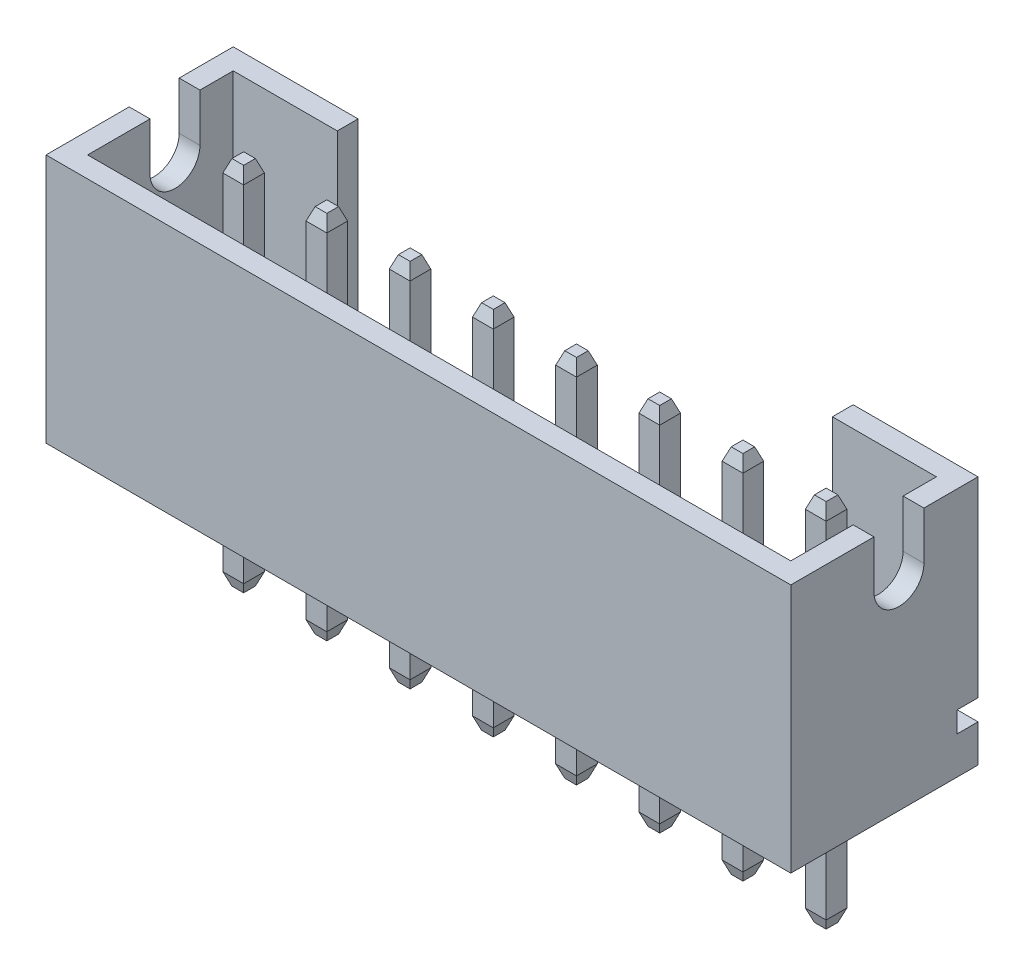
from build123d import *
from OCP.BRepFilletAPI import BRepFilletAPI_MakeChamfer

# Parameters (mm, degrees)
EXTRUDE_3_DEPTH                     = 15.95
EXTRUDE_3_DEPTH_BACK                = 1.95
CUT_EXTRUDE_1_DEPTH                 = 4
EXTRUDE_START                       = -3.4
SKETCH_1_W                          = 0.5
SKETCH_1_H                          = 0.5
EXTRUDE_4_DEPTH                     = 8.9
CHAMFER_1_SIZE                      = 0.3
CHAMFER_1_SIZE2                     = 0.10919107
CHAMFER_2_SIZE                      = 0.3
CHAMFER_2_SIZE2                     = 0.10919107
PATTERN_LINEAR_3_COUNT              = 8
PATTERN_LINEAR_3_PITCH              = 2
CHAMFER_1_OF_PATTERN_LINEAR_3_SIZE  = 0.3
CHAMFER_1_OF_PATTERN_LINEAR_3_SIZE2 = 0.10919107
CHAMFER_2_OF_PATTERN_LINEAR_3_SIZE  = 0.3
CHAMFER_2_OF_PATTERN_LINEAR_3_SIZE2 = 0.10919107


with BuildPart() as part:
    # Sketch 3 → Extrude 3 (new, two sides: drawn at the far end of the back side and taken through both)
    with BuildSketch(Plane(origin=(0, 0, 0), x_dir=(0, 0, -1), z_dir=(1, 0, 0)).offset(-EXTRUDE_3_DEPTH_BACK)):
        with BuildLine():
            Line((-2.8, 0), (1.7, 0))
            Line((1.7, 0), (1.7, 0.9))
            Line((1.7, 0.9), (1.2, 0.9))
            Line((1.2, 0.9), (1.2, 1.4))
            Line((1.2, 1.4), (1.7, 1.4))
            Line((1.7, 1.4), (1.7, 6))
            Line((1.7, 6), (0.4, 6))
            Line((0.4, 6), (0.4, 4.85))
            ThreePointArc((0.4, 4.85), (-0.2, 4.25), (-0.8, 4.85))
            Line((-0.8, 4.85), (-0.8, 6))
            Line((-0.8, 6), (-2.8, 6))
            Line((-2.8, 6), (-2.8, 0))
        make_face()
    extrude(amount=EXTRUDE_3_DEPTH + EXTRUDE_3_DEPTH_BACK)

    # Sketch 4 → Cut-Extrude 1 (cut)
    with BuildSketch(Plane(origin=(0, 6, 0), x_dir=(-1, 0, 0), z_dir=(0, 1, 0))):
        Polygon((-12.95, -1.2), (-15.45, -1.2), (-15.45, 2.3), (1.45, 2.3), (1.45, -1.2), (-1.05, -1.2), (-1.05, -1.7), (-12.95, -1.7), align=None)
    extrude(amount=-CUT_EXTRUDE_1_DEPTH, mode=Mode.SUBTRACT)

    # Sketch 1 → Extrude 4 (add)
    with BuildSketch(Plane(origin=(0, 0, 0), x_dir=(1, 0, 0), z_dir=(0, 1, 0)).offset(EXTRUDE_START)):
        Rectangle(SKETCH_1_W, SKETCH_1_H)
    extrude_4 = extrude(amount=EXTRUDE_4_DEPTH)

    # Chamfer 1: one chamfer whose edges measure the first distance from different faces: ONE call of the kernel's chamfer builder (chamfer() names one face for all edges)
    chamfer_1_edges_1 = [part.edges().sort_by_distance(p)[0] for p in [
        (0, 5.5, 0.25),
    ]]
    chamfer_1_side_1 = [part.faces().sort_by_distance(p)[0] for p in [
        (0, 3.75, 0.25),
    ]]
    chamfer_1_edges_2 = [part.edges().sort_by_distance(p)[0] for p in [
        (0.25, 5.5, 0),
    ]]
    chamfer_1_side_2 = [part.faces().sort_by_distance(p)[0] for p in [
        (0.25, 3.75, 0),
    ]]
    chamfer_1_edges_3 = [part.edges().sort_by_distance(p)[0] for p in [
        (0, 5.5, -0.25),
    ]]
    chamfer_1_side_3 = [part.faces().sort_by_distance(p)[0] for p in [
        (0, 3.75, -0.25),
    ]]
    chamfer_1_edges_4 = [part.edges().sort_by_distance(p)[0] for p in [
        (-0.25, 5.5, 0),
    ]]
    chamfer_1_side_4 = [part.faces().sort_by_distance(p)[0] for p in [
        (-0.25, 3.75, 0),
    ]]
    chamfer_1 = BRepFilletAPI_MakeChamfer(part.part.solid().wrapped)
    for e in chamfer_1_edges_1:
        chamfer_1.Add(CHAMFER_1_SIZE, CHAMFER_1_SIZE2, e.wrapped, chamfer_1_side_1[0].wrapped)  # the first distance lies on this face
    for e in chamfer_1_edges_2:
        chamfer_1.Add(CHAMFER_1_SIZE, CHAMFER_1_SIZE2, e.wrapped, chamfer_1_side_2[0].wrapped)  # the first distance lies on this face
    for e in chamfer_1_edges_3:
        chamfer_1.Add(CHAMFER_1_SIZE, CHAMFER_1_SIZE2, e.wrapped, chamfer_1_side_3[0].wrapped)  # the first distance lies on this face
    for e in chamfer_1_edges_4:
        chamfer_1.Add(CHAMFER_1_SIZE, CHAMFER_1_SIZE2, e.wrapped, chamfer_1_side_4[0].wrapped)  # the first distance lies on this face
    add(Compound.cast(chamfer_1.Shape()), mode=Mode.REPLACE)

    # Chamfer 2: one chamfer whose edges measure the first distance from different faces: ONE call of the kernel's chamfer builder (chamfer() names one face for all edges)
    chamfer_2_edges_1 = [part.edges().sort_by_distance(p)[0] for p in [
        (-0.25, -3.4, 0),
    ]]
    chamfer_2_side_1 = [part.faces().sort_by_distance(p)[0] for p in [
        (-0.25, -1.7, 0),
    ]]
    chamfer_2_edges_2 = [part.edges().sort_by_distance(p)[0] for p in [
        (0, -3.4, -0.25),
    ]]
    chamfer_2_side_2 = [part.faces().sort_by_distance(p)[0] for p in [
        (0, -1.7, -0.25),
    ]]
    chamfer_2_edges_3 = [part.edges().sort_by_distance(p)[0] for p in [
        (0.25, -3.4, 0),
    ]]
    chamfer_2_side_3 = [part.faces().sort_by_distance(p)[0] for p in [
        (0.25, -1.7, 0),
    ]]
    chamfer_2_edges_4 = [part.edges().sort_by_distance(p)[0] for p in [
        (0, -3.4, 0.25),
    ]]
    chamfer_2_side_4 = [part.faces().sort_by_distance(p)[0] for p in [
        (0, -1.7, 0.25),
    ]]
    chamfer_2 = BRepFilletAPI_MakeChamfer(part.part.solid().wrapped)
    for e in chamfer_2_edges_1:
        chamfer_2.Add(CHAMFER_2_SIZE, CHAMFER_2_SIZE2, e.wrapped, chamfer_2_side_1[0].wrapped)  # the first distance lies on this face
    for e in chamfer_2_edges_2:
        chamfer_2.Add(CHAMFER_2_SIZE, CHAMFER_2_SIZE2, e.wrapped, chamfer_2_side_2[0].wrapped)  # the first distance lies on this face
    for e in chamfer_2_edges_3:
        chamfer_2.Add(CHAMFER_2_SIZE, CHAMFER_2_SIZE2, e.wrapped, chamfer_2_side_3[0].wrapped)  # the first distance lies on this face
    for e in chamfer_2_edges_4:
        chamfer_2.Add(CHAMFER_2_SIZE, CHAMFER_2_SIZE2, e.wrapped, chamfer_2_side_4[0].wrapped)  # the first distance lies on this face
    add(Compound.cast(chamfer_2.Shape()), mode=Mode.REPLACE)

    # Pattern Linear 3: Extrude 4 ×8
    with Locations(*[(i * PATTERN_LINEAR_3_PITCH, 0, 0) for i in range(1, PATTERN_LINEAR_3_COUNT)]):
        add(extrude_4)

    # Chamfer 1 of Pattern Linear 3: one chamfer whose edges measure the first distance from different faces: ONE call of the kernel's chamfer builder (chamfer() names one face for all edges)
    chamfer_1_of_pattern_linear_3_edges_1 = [part.edges().sort_by_distance(p)[0] for p in [
        (2, 5.5, 0.25),
    ]]
    chamfer_1_of_pattern_linear_3_side_1 = [part.faces().sort_by_distance(p)[0] for p in [
        (2, 3.75, 0.25),
    ]]
    chamfer_1_of_pattern_linear_3_edges_2 = [part.edges().sort_by_distance(p)[0] for p in [
        (2.25, 5.5, 0),
    ]]
    chamfer_1_of_pattern_linear_3_side_2 = [part.faces().sort_by_distance(p)[0] for p in [
        (2.25, 3.75, 0),
    ]]
    chamfer_1_of_pattern_linear_3_edges_3 = [part.edges().sort_by_distance(p)[0] for p in [
        (2, 5.5, -0.25),
    ]]
    chamfer_1_of_pattern_linear_3_side_3 = [part.faces().sort_by_distance(p)[0] for p in [
        (2, 3.75, -0.25),
    ]]
    chamfer_1_of_pattern_linear_3_edges_4 = [part.edges().sort_by_distance(p)[0] for p in [
        (1.75, 5.5, 0),
    ]]
    chamfer_1_of_pattern_linear_3_side_4 = [part.faces().sort_by_distance(p)[0] for p in [
        (1.75, 3.75, 0),
    ]]
    chamfer_1_of_pattern_linear_3_edges_5 = [part.edges().sort_by_distance(p)[0] for p in [
        (4, 5.5, 0.25),
    ]]
    chamfer_1_of_pattern_linear_3_side_5 = [part.faces().sort_by_distance(p)[0] for p in [
        (4, 3.75, 0.25),
    ]]
    chamfer_1_of_pattern_linear_3_edges_6 = [part.edges().sort_by_distance(p)[0] for p in [
        (4.25, 5.5, 0),
    ]]
    chamfer_1_of_pattern_linear_3_side_6 = [part.faces().sort_by_distance(p)[0] for p in [
        (4.25, 3.75, 0),
    ]]
    chamfer_1_of_pattern_linear_3_edges_7 = [part.edges().sort_by_distance(p)[0] for p in [
        (4, 5.5, -0.25),
    ]]
    chamfer_1_of_pattern_linear_3_side_7 = [part.faces().sort_by_distance(p)[0] for p in [
        (4, 3.75, -0.25),
    ]]
    chamfer_1_of_pattern_linear_3_edges_8 = [part.edges().sort_by_distance(p)[0] for p in [
        (3.75, 5.5, 0),
    ]]
    chamfer_1_of_pattern_linear_3_side_8 = [part.faces().sort_by_distance(p)[0] for p in [
        (3.75, 3.75, 0),
    ]]
    chamfer_1_of_pattern_linear_3_edges_9 = [part.edges().sort_by_distance(p)[0] for p in [
        (6, 5.5, 0.25),
    ]]
    chamfer_1_of_pattern_linear_3_side_9 = [part.faces().sort_by_distance(p)[0] for p in [
        (6, 3.75, 0.25),
    ]]
    chamfer_1_of_pattern_linear_3_edges_10 = [part.edges().sort_by_distance(p)[0] for p in [
        (6.25, 5.5, 0),
    ]]
    chamfer_1_of_pattern_linear_3_side_10 = [part.faces().sort_by_distance(p)[0] for p in [
        (6.25, 3.75, 0),
    ]]
    chamfer_1_of_pattern_linear_3_edges_11 = [part.edges().sort_by_distance(p)[0] for p in [
        (6, 5.5, -0.25),
    ]]
    chamfer_1_of_pattern_linear_3_side_11 = [part.faces().sort_by_distance(p)[0] for p in [
        (6, 3.75, -0.25),
    ]]
    chamfer_1_of_pattern_linear_3_edges_12 = [part.edges().sort_by_distance(p)[0] for p in [
        (5.75, 5.5, 0),
    ]]
    chamfer_1_of_pattern_linear_3_side_12 = [part.faces().sort_by_distance(p)[0] for p in [
        (5.75, 3.75, 0),
    ]]
    chamfer_1_of_pattern_linear_3_edges_13 = [part.edges().sort_by_distance(p)[0] for p in [
        (8, 5.5, 0.25),
    ]]
    chamfer_1_of_pattern_linear_3_side_13 = [part.faces().sort_by_distance(p)[0] for p in [
        (8, 3.75, 0.25),
    ]]
    chamfer_1_of_pattern_linear_3_edges_14 = [part.edges().sort_by_distance(p)[0] for p in [
        (8.25, 5.5, 0),
    ]]
    chamfer_1_of_pattern_linear_3_side_14 = [part.faces().sort_by_distance(p)[0] for p in [
        (8.25, 3.75, 0),
    ]]
    chamfer_1_of_pattern_linear_3_edges_15 = [part.edges().sort_by_distance(p)[0] for p in [
        (8, 5.5, -0.25),
    ]]
    chamfer_1_of_pattern_linear_3_side_15 = [part.faces().sort_by_distance(p)[0] for p in [
        (8, 3.75, -0.25),
    ]]
    chamfer_1_of_pattern_linear_3_edges_16 = [part.edges().sort_by_distance(p)[0] for p in [
        (7.75, 5.5, 0),
    ]]
    chamfer_1_of_pattern_linear_3_side_16 = [part.faces().sort_by_distance(p)[0] for p in [
        (7.75, 3.75, 0),
    ]]
    chamfer_1_of_pattern_linear_3_edges_17 = [part.edges().sort_by_distance(p)[0] for p in [
        (10, 5.5, 0.25),
    ]]
    chamfer_1_of_pattern_linear_3_side_17 = [part.faces().sort_by_distance(p)[0] for p in [
        (10, 3.75, 0.25),
    ]]
    chamfer_1_of_pattern_linear_3_edges_18 = [part.edges().sort_by_distance(p)[0] for p in [
        (10.25, 5.5, 0),
    ]]
    chamfer_1_of_pattern_linear_3_side_18 = [part.faces().sort_by_distance(p)[0] for p in [
        (10.25, 3.75, 0),
    ]]
    chamfer_1_of_pattern_linear_3_edges_19 = [part.edges().sort_by_distance(p)[0] for p in [
        (10, 5.5, -0.25),
    ]]
    chamfer_1_of_pattern_linear_3_side_19 = [part.faces().sort_by_distance(p)[0] for p in [
        (10, 3.75, -0.25),
    ]]
    chamfer_1_of_pattern_linear_3_edges_20 = [part.edges().sort_by_distance(p)[0] for p in [
        (9.75, 5.5, 0),
    ]]
    chamfer_1_of_pattern_linear_3_side_20 = [part.faces().sort_by_distance(p)[0] for p in [
        (9.75, 3.75, 0),
    ]]
    chamfer_1_of_pattern_linear_3_edges_21 = [part.edges().sort_by_distance(p)[0] for p in [
        (12, 5.5, 0.25),
    ]]
    chamfer_1_of_pattern_linear_3_side_21 = [part.faces().sort_by_distance(p)[0] for p in [
        (12, 3.75, 0.25),
    ]]
    chamfer_1_of_pattern_linear_3_edges_22 = [part.edges().sort_by_distance(p)[0] for p in [
        (12.25, 5.5, 0),
    ]]
    chamfer_1_of_pattern_linear_3_side_22 = [part.faces().sort_by_distance(p)[0] for p in [
        (12.25, 3.75, 0),
    ]]
    chamfer_1_of_pattern_linear_3_edges_23 = [part.edges().sort_by_distance(p)[0] for p in [
        (12, 5.5, -0.25),
    ]]
    chamfer_1_of_pattern_linear_3_side_23 = [part.faces().sort_by_distance(p)[0] for p in [
        (12, 3.75, -0.25),
    ]]
    chamfer_1_of_pattern_linear_3_edges_24 = [part.edges().sort_by_distance(p)[0] for p in [
        (11.75, 5.5, 0),
    ]]
    chamfer_1_of_pattern_linear_3_side_24 = [part.faces().sort_by_distance(p)[0] for p in [
        (11.75, 3.75, 0),
    ]]
    chamfer_1_of_pattern_linear_3_edges_25 = [part.edges().sort_by_distance(p)[0] for p in [
        (14, 5.5, 0.25),
    ]]
    chamfer_1_of_pattern_linear_3_side_25 = [part.faces().sort_by_distance(p)[0] for p in [
        (14, 3.75, 0.25),
    ]]
    chamfer_1_of_pattern_linear_3_edges_26 = [part.edges().sort_by_distance(p)[0] for p in [
        (14.25, 5.5, 0),
    ]]
    chamfer_1_of_pattern_linear_3_side_26 = [part.faces().sort_by_distance(p)[0] for p in [
        (14.25, 3.75, 0),
    ]]
    chamfer_1_of_pattern_linear_3_edges_27 = [part.edges().sort_by_distance(p)[0] for p in [
        (14, 5.5, -0.25),
    ]]
    chamfer_1_of_pattern_linear_3_side_27 = [part.faces().sort_by_distance(p)[0] for p in [
        (14, 3.75, -0.25),
    ]]
    chamfer_1_of_pattern_linear_3_edges_28 = [part.edges().sort_by_distance(p)[0] for p in [
        (13.75, 5.5, 0),
    ]]
    chamfer_1_of_pattern_linear_3_side_28 = [part.faces().sort_by_distance(p)[0] for p in [
        (13.75, 3.75, 0),
    ]]
    chamfer_1_of_pattern_linear_3 = BRepFilletAPI_MakeChamfer(part.part.solid().wrapped)
    for e in chamfer_1_of_pattern_linear_3_edges_1:
        chamfer_1_of_pattern_linear_3.Add(CHAMFER_1_OF_PATTERN_LINEAR_3_SIZE, CHAMFER_1_OF_PATTERN_LINEAR_3_SIZE2, e.wrapped, chamfer_1_of_pattern_linear_3_side_1[0].wrapped)  # the first distance lies on this face
    for e in chamfer_1_of_pattern_linear_3_edges_2:
        chamfer_1_of_pattern_linear_3.Add(CHAMFER_1_OF_PATTERN_LINEAR_3_SIZE, CHAMFER_1_OF_PATTERN_LINEAR_3_SIZE2, e.wrapped, chamfer_1_of_pattern_linear_3_side_2[0].wrapped)  # the first distance lies on this face
    for e in chamfer_1_of_pattern_linear_3_edges_3:
        chamfer_1_of_pattern_linear_3.Add(CHAMFER_1_OF_PATTERN_LINEAR_3_SIZE, CHAMFER_1_OF_PATTERN_LINEAR_3_SIZE2, e.wrapped, chamfer_1_of_pattern_linear_3_side_3[0].wrapped)  # the first distance lies on this face
    for e in chamfer_1_of_pattern_linear_3_edges_4:
        chamfer_1_of_pattern_linear_3.Add(CHAMFER_1_OF_PATTERN_LINEAR_3_SIZE, CHAMFER_1_OF_PATTERN_LINEAR_3_SIZE2, e.wrapped, chamfer_1_of_pattern_linear_3_side_4[0].wrapped)  # the first distance lies on this face
    for e in chamfer_1_of_pattern_linear_3_edges_5:
        chamfer_1_of_pattern_linear_3.Add(CHAMFER_1_OF_PATTERN_LINEAR_3_SIZE, CHAMFER_1_OF_PATTERN_LINEAR_3_SIZE2, e.wrapped, chamfer_1_of_pattern_linear_3_side_5[0].wrapped)  # the first distance lies on this face
    for e in chamfer_1_of_pattern_linear_3_edges_6:
        chamfer_1_of_pattern_linear_3.Add(CHAMFER_1_OF_PATTERN_LINEAR_3_SIZE, CHAMFER_1_OF_PATTERN_LINEAR_3_SIZE2, e.wrapped, chamfer_1_of_pattern_linear_3_side_6[0].wrapped)  # the first distance lies on this face
    for e in chamfer_1_of_pattern_linear_3_edges_7:
        chamfer_1_of_pattern_linear_3.Add(CHAMFER_1_OF_PATTERN_LINEAR_3_SIZE, CHAMFER_1_OF_PATTERN_LINEAR_3_SIZE2, e.wrapped, chamfer_1_of_pattern_linear_3_side_7[0].wrapped)  # the first distance lies on this face
    for e in chamfer_1_of_pattern_linear_3_edges_8:
        chamfer_1_of_pattern_linear_3.Add(CHAMFER_1_OF_PATTERN_LINEAR_3_SIZE, CHAMFER_1_OF_PATTERN_LINEAR_3_SIZE2, e.wrapped, chamfer_1_of_pattern_linear_3_side_8[0].wrapped)  # the first distance lies on this face
    for e in chamfer_1_of_pattern_linear_3_edges_9:
        chamfer_1_of_pattern_linear_3.Add(CHAMFER_1_OF_PATTERN_LINEAR_3_SIZE, CHAMFER_1_OF_PATTERN_LINEAR_3_SIZE2, e.wrapped, chamfer_1_of_pattern_linear_3_side_9[0].wrapped)  # the first distance lies on this face
    for e in chamfer_1_of_pattern_linear_3_edges_10:
        chamfer_1_of_pattern_linear_3.Add(CHAMFER_1_OF_PATTERN_LINEAR_3_SIZE, CHAMFER_1_OF_PATTERN_LINEAR_3_SIZE2, e.wrapped, chamfer_1_of_pattern_linear_3_side_10[0].wrapped)  # the first distance lies on this face
    for e in chamfer_1_of_pattern_linear_3_edges_11:
        chamfer_1_of_pattern_linear_3.Add(CHAMFER_1_OF_PATTERN_LINEAR_3_SIZE, CHAMFER_1_OF_PATTERN_LINEAR_3_SIZE2, e.wrapped, chamfer_1_of_pattern_linear_3_side_11[0].wrapped)  # the first distance lies on this face
    for e in chamfer_1_of_pattern_linear_3_edges_12:
        chamfer_1_of_pattern_linear_3.Add(CHAMFER_1_OF_PATTERN_LINEAR_3_SIZE, CHAMFER_1_OF_PATTERN_LINEAR_3_SIZE2, e.wrapped, chamfer_1_of_pattern_linear_3_side_12[0].wrapped)  # the first distance lies on this face
    for e in chamfer_1_of_pattern_linear_3_edges_13:
        chamfer_1_of_pattern_linear_3.Add(CHAMFER_1_OF_PATTERN_LINEAR_3_SIZE, CHAMFER_1_OF_PATTERN_LINEAR_3_SIZE2, e.wrapped, chamfer_1_of_pattern_linear_3_side_13[0].wrapped)  # the first distance lies on this face
    for e in chamfer_1_of_pattern_linear_3_edges_14:
        chamfer_1_of_pattern_linear_3.Add(CHAMFER_1_OF_PATTERN_LINEAR_3_SIZE, CHAMFER_1_OF_PATTERN_LINEAR_3_SIZE2, e.wrapped, chamfer_1_of_pattern_linear_3_side_14[0].wrapped)  # the first distance lies on this face
    for e in chamfer_1_of_pattern_linear_3_edges_15:
        chamfer_1_of_pattern_linear_3.Add(CHAMFER_1_OF_PATTERN_LINEAR_3_SIZE, CHAMFER_1_OF_PATTERN_LINEAR_3_SIZE2, e.wrapped, chamfer_1_of_pattern_linear_3_side_15[0].wrapped)  # the first distance lies on this face
    for e in chamfer_1_of_pattern_linear_3_edges_16:
        chamfer_1_of_pattern_linear_3.Add(CHAMFER_1_OF_PATTERN_LINEAR_3_SIZE, CHAMFER_1_OF_PATTERN_LINEAR_3_SIZE2, e.wrapped, chamfer_1_of_pattern_linear_3_side_16[0].wrapped)  # the first distance lies on this face
    for e in chamfer_1_of_pattern_linear_3_edges_17:
        chamfer_1_of_pattern_linear_3.Add(CHAMFER_1_OF_PATTERN_LINEAR_3_SIZE, CHAMFER_1_OF_PATTERN_LINEAR_3_SIZE2, e.wrapped, chamfer_1_of_pattern_linear_3_side_17[0].wrapped)  # the first distance lies on this face
    for e in chamfer_1_of_pattern_linear_3_edges_18:
        chamfer_1_of_pattern_linear_3.Add(CHAMFER_1_OF_PATTERN_LINEAR_3_SIZE, CHAMFER_1_OF_PATTERN_LINEAR_3_SIZE2, e.wrapped, chamfer_1_of_pattern_linear_3_side_18[0].wrapped)  # the first distance lies on this face
    for e in chamfer_1_of_pattern_linear_3_edges_19:
        chamfer_1_of_pattern_linear_3.Add(CHAMFER_1_OF_PATTERN_LINEAR_3_SIZE, CHAMFER_1_OF_PATTERN_LINEAR_3_SIZE2, e.wrapped, chamfer_1_of_pattern_linear_3_side_19[0].wrapped)  # the first distance lies on this face
    for e in chamfer_1_of_pattern_linear_3_edges_20:
        chamfer_1_of_pattern_linear_3.Add(CHAMFER_1_OF_PATTERN_LINEAR_3_SIZE, CHAMFER_1_OF_PATTERN_LINEAR_3_SIZE2, e.wrapped, chamfer_1_of_pattern_linear_3_side_20[0].wrapped)  # the first distance lies on this face
    for e in chamfer_1_of_pattern_linear_3_edges_21:
        chamfer_1_of_pattern_linear_3.Add(CHAMFER_1_OF_PATTERN_LINEAR_3_SIZE, CHAMFER_1_OF_PATTERN_LINEAR_3_SIZE2, e.wrapped, chamfer_1_of_pattern_linear_3_side_21[0].wrapped)  # the first distance lies on this face
    for e in chamfer_1_of_pattern_linear_3_edges_22:
        chamfer_1_of_pattern_linear_3.Add(CHAMFER_1_OF_PATTERN_LINEAR_3_SIZE, CHAMFER_1_OF_PATTERN_LINEAR_3_SIZE2, e.wrapped, chamfer_1_of_pattern_linear_3_side_22[0].wrapped)  # the first distance lies on this face
    for e in chamfer_1_of_pattern_linear_3_edges_23:
        chamfer_1_of_pattern_linear_3.Add(CHAMFER_1_OF_PATTERN_LINEAR_3_SIZE, CHAMFER_1_OF_PATTERN_LINEAR_3_SIZE2, e.wrapped, chamfer_1_of_pattern_linear_3_side_23[0].wrapped)  # the first distance lies on this face
    for e in chamfer_1_of_pattern_linear_3_edges_24:
        chamfer_1_of_pattern_linear_3.Add(CHAMFER_1_OF_PATTERN_LINEAR_3_SIZE, CHAMFER_1_OF_PATTERN_LINEAR_3_SIZE2, e.wrapped, chamfer_1_of_pattern_linear_3_side_24[0].wrapped)  # the first distance lies on this face
    for e in chamfer_1_of_pattern_linear_3_edges_25:
        chamfer_1_of_pattern_linear_3.Add(CHAMFER_1_OF_PATTERN_LINEAR_3_SIZE, CHAMFER_1_OF_PATTERN_LINEAR_3_SIZE2, e.wrapped, chamfer_1_of_pattern_linear_3_side_25[0].wrapped)  # the first distance lies on this face
    for e in chamfer_1_of_pattern_linear_3_edges_26:
        chamfer_1_of_pattern_linear_3.Add(CHAMFER_1_OF_PATTERN_LINEAR_3_SIZE, CHAMFER_1_OF_PATTERN_LINEAR_3_SIZE2, e.wrapped, chamfer_1_of_pattern_linear_3_side_26[0].wrapped)  # the first distance lies on this face
    for e in chamfer_1_of_pattern_linear_3_edges_27:
        chamfer_1_of_pattern_linear_3.Add(CHAMFER_1_OF_PATTERN_LINEAR_3_SIZE, CHAMFER_1_OF_PATTERN_LINEAR_3_SIZE2, e.wrapped, chamfer_1_of_pattern_linear_3_side_27[0].wrapped)  # the first distance lies on this face
    for e in chamfer_1_of_pattern_linear_3_edges_28:
        chamfer_1_of_pattern_linear_3.Add(CHAMFER_1_OF_PATTERN_LINEAR_3_SIZE, CHAMFER_1_OF_PATTERN_LINEAR_3_SIZE2, e.wrapped, chamfer_1_of_pattern_linear_3_side_28[0].wrapped)  # the first distance lies on this face
    add(Compound.cast(chamfer_1_of_pattern_linear_3.Shape()), mode=Mode.REPLACE)

    # Chamfer 2 of Pattern Linear 3: one chamfer whose edges measure the first distance from different faces: ONE call of the kernel's chamfer builder (chamfer() names one face for all edges)
    chamfer_2_of_pattern_linear_3_edges_1 = [part.edges().sort_by_distance(p)[0] for p in [
        (1.75, -3.4, 0),
    ]]
    chamfer_2_of_pattern_linear_3_side_1 = [part.faces().sort_by_distance(p)[0] for p in [
        (1.75, -1.7, 0),
    ]]
    chamfer_2_of_pattern_linear_3_edges_2 = [part.edges().sort_by_distance(p)[0] for p in [
        (2, -3.4, -0.25),
    ]]
    chamfer_2_of_pattern_linear_3_side_2 = [part.faces().sort_by_distance(p)[0] for p in [
        (2, -1.7, -0.25),
    ]]
    chamfer_2_of_pattern_linear_3_edges_3 = [part.edges().sort_by_distance(p)[0] for p in [
        (2.25, -3.4, 0),
    ]]
    chamfer_2_of_pattern_linear_3_side_3 = [part.faces().sort_by_distance(p)[0] for p in [
        (2.25, -1.7, 0),
    ]]
    chamfer_2_of_pattern_linear_3_edges_4 = [part.edges().sort_by_distance(p)[0] for p in [
        (2, -3.4, 0.25),
    ]]
    chamfer_2_of_pattern_linear_3_side_4 = [part.faces().sort_by_distance(p)[0] for p in [
        (2, -1.7, 0.25),
    ]]
    chamfer_2_of_pattern_linear_3_edges_5 = [part.edges().sort_by_distance(p)[0] for p in [
        (3.75, -3.4, 0),
    ]]
    chamfer_2_of_pattern_linear_3_side_5 = [part.faces().sort_by_distance(p)[0] for p in [
        (3.75, -1.7, 0),
    ]]
    chamfer_2_of_pattern_linear_3_edges_6 = [part.edges().sort_by_distance(p)[0] for p in [
        (4, -3.4, -0.25),
    ]]
    chamfer_2_of_pattern_linear_3_side_6 = [part.faces().sort_by_distance(p)[0] for p in [
        (4, -1.7, -0.25),
    ]]
    chamfer_2_of_pattern_linear_3_edges_7 = [part.edges().sort_by_distance(p)[0] for p in [
        (4.25, -3.4, 0),
    ]]
    chamfer_2_of_pattern_linear_3_side_7 = [part.faces().sort_by_distance(p)[0] for p in [
        (4.25, -1.7, 0),
    ]]
    chamfer_2_of_pattern_linear_3_edges_8 = [part.edges().sort_by_distance(p)[0] for p in [
        (4, -3.4, 0.25),
    ]]
    chamfer_2_of_pattern_linear_3_side_8 = [part.faces().sort_by_distance(p)[0] for p in [
        (4, -1.7, 0.25),
    ]]
    chamfer_2_of_pattern_linear_3_edges_9 = [part.edges().sort_by_distance(p)[0] for p in [
        (5.75, -3.4, 0),
    ]]
    chamfer_2_of_pattern_linear_3_side_9 = [part.faces().sort_by_distance(p)[0] for p in [
        (5.75, -1.7, 0),
    ]]
    chamfer_2_of_pattern_linear_3_edges_10 = [part.edges().sort_by_distance(p)[0] for p in [
        (6, -3.4, -0.25),
    ]]
    chamfer_2_of_pattern_linear_3_side_10 = [part.faces().sort_by_distance(p)[0] for p in [
        (6, -1.7, -0.25),
    ]]
    chamfer_2_of_pattern_linear_3_edges_11 = [part.edges().sort_by_distance(p)[0] for p in [
        (6.25, -3.4, 0),
    ]]
    chamfer_2_of_pattern_linear_3_side_11 = [part.faces().sort_by_distance(p)[0] for p in [
        (6.25, -1.7, 0),
    ]]
    chamfer_2_of_pattern_linear_3_edges_12 = [part.edges().sort_by_distance(p)[0] for p in [
        (6, -3.4, 0.25),
    ]]
    chamfer_2_of_pattern_linear_3_side_12 = [part.faces().sort_by_distance(p)[0] for p in [
        (6, -1.7, 0.25),
    ]]
    chamfer_2_of_pattern_linear_3_edges_13 = [part.edges().sort_by_distance(p)[0] for p in [
        (7.75, -3.4, 0),
    ]]
    chamfer_2_of_pattern_linear_3_side_13 = [part.faces().sort_by_distance(p)[0] for p in [
        (7.75, -1.7, 0),
    ]]
    chamfer_2_of_pattern_linear_3_edges_14 = [part.edges().sort_by_distance(p)[0] for p in [
        (8, -3.4, -0.25),
    ]]
    chamfer_2_of_pattern_linear_3_side_14 = [part.faces().sort_by_distance(p)[0] for p in [
        (8, -1.7, -0.25),
    ]]
    chamfer_2_of_pattern_linear_3_edges_15 = [part.edges().sort_by_distance(p)[0] for p in [
        (8.25, -3.4, 0),
    ]]
    chamfer_2_of_pattern_linear_3_side_15 = [part.faces().sort_by_distance(p)[0] for p in [
        (8.25, -1.7, 0),
    ]]
    chamfer_2_of_pattern_linear_3_edges_16 = [part.edges().sort_by_distance(p)[0] for p in [
        (8, -3.4, 0.25),
    ]]
    chamfer_2_of_pattern_linear_3_side_16 = [part.faces().sort_by_distance(p)[0] for p in [
        (8, -1.7, 0.25),
    ]]
    chamfer_2_of_pattern_linear_3_edges_17 = [part.edges().sort_by_distance(p)[0] for p in [
        (9.75, -3.4, 0),
    ]]
    chamfer_2_of_pattern_linear_3_side_17 = [part.faces().sort_by_distance(p)[0] for p in [
        (9.75, -1.7, 0),
    ]]
    chamfer_2_of_pattern_linear_3_edges_18 = [part.edges().sort_by_distance(p)[0] for p in [
        (10, -3.4, -0.25),
    ]]
    chamfer_2_of_pattern_linear_3_side_18 = [part.faces().sort_by_distance(p)[0] for p in [
        (10, -1.7, -0.25),
    ]]
    chamfer_2_of_pattern_linear_3_edges_19 = [part.edges().sort_by_distance(p)[0] for p in [
        (10.25, -3.4, 0),
    ]]
    chamfer_2_of_pattern_linear_3_side_19 = [part.faces().sort_by_distance(p)[0] for p in [
        (10.25, -1.7, 0),
    ]]
    chamfer_2_of_pattern_linear_3_edges_20 = [part.edges().sort_by_distance(p)[0] for p in [
        (10, -3.4, 0.25),
    ]]
    chamfer_2_of_pattern_linear_3_side_20 = [part.faces().sort_by_distance(p)[0] for p in [
        (10, -1.7, 0.25),
    ]]
    chamfer_2_of_pattern_linear_3_edges_21 = [part.edges().sort_by_distance(p)[0] for p in [
        (11.75, -3.4, 0),
    ]]
    chamfer_2_of_pattern_linear_3_side_21 = [part.faces().sort_by_distance(p)[0] for p in [
        (11.75, -1.7, 0),
    ]]
    chamfer_2_of_pattern_linear_3_edges_22 = [part.edges().sort_by_distance(p)[0] for p in [
        (12, -3.4, -0.25),
    ]]
    chamfer_2_of_pattern_linear_3_side_22 = [part.faces().sort_by_distance(p)[0] for p in [
        (12, -1.7, -0.25),
    ]]
    chamfer_2_of_pattern_linear_3_edges_23 = [part.edges().sort_by_distance(p)[0] for p in [
        (12.25, -3.4, 0),
    ]]
    chamfer_2_of_pattern_linear_3_side_23 = [part.faces().sort_by_distance(p)[0] for p in [
        (12.25, -1.7, 0),
    ]]
    chamfer_2_of_pattern_linear_3_edges_24 = [part.edges().sort_by_distance(p)[0] for p in [
        (12, -3.4, 0.25),
    ]]
    chamfer_2_of_pattern_linear_3_side_24 = [part.faces().sort_by_distance(p)[0] for p in [
        (12, -1.7, 0.25),
    ]]
    chamfer_2_of_pattern_linear_3_edges_25 = [part.edges().sort_by_distance(p)[0] for p in [
        (13.75, -3.4, 0),
    ]]
    chamfer_2_of_pattern_linear_3_side_25 = [part.faces().sort_by_distance(p)[0] for p in [
        (13.75, -1.7, 0),
    ]]
    chamfer_2_of_pattern_linear_3_edges_26 = [part.edges().sort_by_distance(p)[0] for p in [
        (14, -3.4, -0.25),
    ]]
    chamfer_2_of_pattern_linear_3_side_26 = [part.faces().sort_by_distance(p)[0] for p in [
        (14, -1.7, -0.25),
    ]]
    chamfer_2_of_pattern_linear_3_edges_27 = [part.edges().sort_by_distance(p)[0] for p in [
        (14.25, -3.4, 0),
    ]]
    chamfer_2_of_pattern_linear_3_side_27 = [part.faces().sort_by_distance(p)[0] for p in [
        (14.25, -1.7, 0),
    ]]
    chamfer_2_of_pattern_linear_3_edges_28 = [part.edges().sort_by_distance(p)[0] for p in [
        (14, -3.4, 0.25),
    ]]
    chamfer_2_of_pattern_linear_3_side_28 = [part.faces().sort_by_distance(p)[0] for p in [
        (14, -1.7, 0.25),
    ]]
    chamfer_2_of_pattern_linear_3 = BRepFilletAPI_MakeChamfer(part.part.solid().wrapped)
    for e in chamfer_2_of_pattern_linear_3_edges_1:
        chamfer_2_of_pattern_linear_3.Add(CHAMFER_2_OF_PATTERN_LINEAR_3_SIZE, CHAMFER_2_OF_PATTERN_LINEAR_3_SIZE2, e.wrapped, chamfer_2_of_pattern_linear_3_side_1[0].wrapped)  # the first distance lies on this face
    for e in chamfer_2_of_pattern_linear_3_edges_2:
        chamfer_2_of_pattern_linear_3.Add(CHAMFER_2_OF_PATTERN_LINEAR_3_SIZE, CHAMFER_2_OF_PATTERN_LINEAR_3_SIZE2, e.wrapped, chamfer_2_of_pattern_linear_3_side_2[0].wrapped)  # the first distance lies on this face
    for e in chamfer_2_of_pattern_linear_3_edges_3:
        chamfer_2_of_pattern_linear_3.Add(CHAMFER_2_OF_PATTERN_LINEAR_3_SIZE, CHAMFER_2_OF_PATTERN_LINEAR_3_SIZE2, e.wrapped, chamfer_2_of_pattern_linear_3_side_3[0].wrapped)  # the first distance lies on this face
    for e in chamfer_2_of_pattern_linear_3_edges_4:
        chamfer_2_of_pattern_linear_3.Add(CHAMFER_2_OF_PATTERN_LINEAR_3_SIZE, CHAMFER_2_OF_PATTERN_LINEAR_3_SIZE2, e.wrapped, chamfer_2_of_pattern_linear_3_side_4[0].wrapped)  # the first distance lies on this face
    for e in chamfer_2_of_pattern_linear_3_edges_5:
        chamfer_2_of_pattern_linear_3.Add(CHAMFER_2_OF_PATTERN_LINEAR_3_SIZE, CHAMFER_2_OF_PATTERN_LINEAR_3_SIZE2, e.wrapped, chamfer_2_of_pattern_linear_3_side_5[0].wrapped)  # the first distance lies on this face
    for e in chamfer_2_of_pattern_linear_3_edges_6:
        chamfer_2_of_pattern_linear_3.Add(CHAMFER_2_OF_PATTERN_LINEAR_3_SIZE, CHAMFER_2_OF_PATTERN_LINEAR_3_SIZE2, e.wrapped, chamfer_2_of_pattern_linear_3_side_6[0].wrapped)  # the first distance lies on this face
    for e in chamfer_2_of_pattern_linear_3_edges_7:
        chamfer_2_of_pattern_linear_3.Add(CHAMFER_2_OF_PATTERN_LINEAR_3_SIZE, CHAMFER_2_OF_PATTERN_LINEAR_3_SIZE2, e.wrapped, chamfer_2_of_pattern_linear_3_side_7[0].wrapped)  # the first distance lies on this face
    for e in chamfer_2_of_pattern_linear_3_edges_8:
        chamfer_2_of_pattern_linear_3.Add(CHAMFER_2_OF_PATTERN_LINEAR_3_SIZE, CHAMFER_2_OF_PATTERN_LINEAR_3_SIZE2, e.wrapped, chamfer_2_of_pattern_linear_3_side_8[0].wrapped)  # the first distance lies on this face
    for e in chamfer_2_of_pattern_linear_3_edges_9:
        chamfer_2_of_pattern_linear_3.Add(CHAMFER_2_OF_PATTERN_LINEAR_3_SIZE, CHAMFER_2_OF_PATTERN_LINEAR_3_SIZE2, e.wrapped, chamfer_2_of_pattern_linear_3_side_9[0].wrapped)  # the first distance lies on this face
    for e in chamfer_2_of_pattern_linear_3_edges_10:
        chamfer_2_of_pattern_linear_3.Add(CHAMFER_2_OF_PATTERN_LINEAR_3_SIZE, CHAMFER_2_OF_PATTERN_LINEAR_3_SIZE2, e.wrapped, chamfer_2_of_pattern_linear_3_side_10[0].wrapped)  # the first distance lies on this face
    for e in chamfer_2_of_pattern_linear_3_edges_11:
        chamfer_2_of_pattern_linear_3.Add(CHAMFER_2_OF_PATTERN_LINEAR_3_SIZE, CHAMFER_2_OF_PATTERN_LINEAR_3_SIZE2, e.wrapped, chamfer_2_of_pattern_linear_3_side_11[0].wrapped)  # the first distance lies on this face
    for e in chamfer_2_of_pattern_linear_3_edges_12:
        chamfer_2_of_pattern_linear_3.Add(CHAMFER_2_OF_PATTERN_LINEAR_3_SIZE, CHAMFER_2_OF_PATTERN_LINEAR_3_SIZE2, e.wrapped, chamfer_2_of_pattern_linear_3_side_12[0].wrapped)  # the first distance lies on this face
    for e in chamfer_2_of_pattern_linear_3_edges_13:
        chamfer_2_of_pattern_linear_3.Add(CHAMFER_2_OF_PATTERN_LINEAR_3_SIZE, CHAMFER_2_OF_PATTERN_LINEAR_3_SIZE2, e.wrapped, chamfer_2_of_pattern_linear_3_side_13[0].wrapped)  # the first distance lies on this face
    for e in chamfer_2_of_pattern_linear_3_edges_14:
        chamfer_2_of_pattern_linear_3.Add(CHAMFER_2_OF_PATTERN_LINEAR_3_SIZE, CHAMFER_2_OF_PATTERN_LINEAR_3_SIZE2, e.wrapped, chamfer_2_of_pattern_linear_3_side_14[0].wrapped)  # the first distance lies on this face
    for e in chamfer_2_of_pattern_linear_3_edges_15:
        chamfer_2_of_pattern_linear_3.Add(CHAMFER_2_OF_PATTERN_LINEAR_3_SIZE, CHAMFER_2_OF_PATTERN_LINEAR_3_SIZE2, e.wrapped, chamfer_2_of_pattern_linear_3_side_15[0].wrapped)  # the first distance lies on this face
    for e in chamfer_2_of_pattern_linear_3_edges_16:
        chamfer_2_of_pattern_linear_3.Add(CHAMFER_2_OF_PATTERN_LINEAR_3_SIZE, CHAMFER_2_OF_PATTERN_LINEAR_3_SIZE2, e.wrapped, chamfer_2_of_pattern_linear_3_side_16[0].wrapped)  # the first distance lies on this face
    for e in chamfer_2_of_pattern_linear_3_edges_17:
        chamfer_2_of_pattern_linear_3.Add(CHAMFER_2_OF_PATTERN_LINEAR_3_SIZE, CHAMFER_2_OF_PATTERN_LINEAR_3_SIZE2, e.wrapped, chamfer_2_of_pattern_linear_3_side_17[0].wrapped)  # the first distance lies on this face
    for e in chamfer_2_of_pattern_linear_3_edges_18:
        chamfer_2_of_pattern_linear_3.Add(CHAMFER_2_OF_PATTERN_LINEAR_3_SIZE, CHAMFER_2_OF_PATTERN_LINEAR_3_SIZE2, e.wrapped, chamfer_2_of_pattern_linear_3_side_18[0].wrapped)  # the first distance lies on this face
    for e in chamfer_2_of_pattern_linear_3_edges_19:
        chamfer_2_of_pattern_linear_3.Add(CHAMFER_2_OF_PATTERN_LINEAR_3_SIZE, CHAMFER_2_OF_PATTERN_LINEAR_3_SIZE2, e.wrapped, chamfer_2_of_pattern_linear_3_side_19[0].wrapped)  # the first distance lies on this face
    for e in chamfer_2_of_pattern_linear_3_edges_20:
        chamfer_2_of_pattern_linear_3.Add(CHAMFER_2_OF_PATTERN_LINEAR_3_SIZE, CHAMFER_2_OF_PATTERN_LINEAR_3_SIZE2, e.wrapped, chamfer_2_of_pattern_linear_3_side_20[0].wrapped)  # the first distance lies on this face
    for e in chamfer_2_of_pattern_linear_3_edges_21:
        chamfer_2_of_pattern_linear_3.Add(CHAMFER_2_OF_PATTERN_LINEAR_3_SIZE, CHAMFER_2_OF_PATTERN_LINEAR_3_SIZE2, e.wrapped, chamfer_2_of_pattern_linear_3_side_21[0].wrapped)  # the first distance lies on this face
    for e in chamfer_2_of_pattern_linear_3_edges_22:
        chamfer_2_of_pattern_linear_3.Add(CHAMFER_2_OF_PATTERN_LINEAR_3_SIZE, CHAMFER_2_OF_PATTERN_LINEAR_3_SIZE2, e.wrapped, chamfer_2_of_pattern_linear_3_side_22[0].wrapped)  # the first distance lies on this face
    for e in chamfer_2_of_pattern_linear_3_edges_23:
        chamfer_2_of_pattern_linear_3.Add(CHAMFER_2_OF_PATTERN_LINEAR_3_SIZE, CHAMFER_2_OF_PATTERN_LINEAR_3_SIZE2, e.wrapped, chamfer_2_of_pattern_linear_3_side_23[0].wrapped)  # the first distance lies on this face
    for e in chamfer_2_of_pattern_linear_3_edges_24:
        chamfer_2_of_pattern_linear_3.Add(CHAMFER_2_OF_PATTERN_LINEAR_3_SIZE, CHAMFER_2_OF_PATTERN_LINEAR_3_SIZE2, e.wrapped, chamfer_2_of_pattern_linear_3_side_24[0].wrapped)  # the first distance lies on this face
    for e in chamfer_2_of_pattern_linear_3_edges_25:
        chamfer_2_of_pattern_linear_3.Add(CHAMFER_2_OF_PATTERN_LINEAR_3_SIZE, CHAMFER_2_OF_PATTERN_LINEAR_3_SIZE2, e.wrapped, chamfer_2_of_pattern_linear_3_side_25[0].wrapped)  # the first distance lies on this face
    for e in chamfer_2_of_pattern_linear_3_edges_26:
        chamfer_2_of_pattern_linear_3.Add(CHAMFER_2_OF_PATTERN_LINEAR_3_SIZE, CHAMFER_2_OF_PATTERN_LINEAR_3_SIZE2, e.wrapped, chamfer_2_of_pattern_linear_3_side_26[0].wrapped)  # the first distance lies on this face
    for e in chamfer_2_of_pattern_linear_3_edges_27:
        chamfer_2_of_pattern_linear_3.Add(CHAMFER_2_OF_PATTERN_LINEAR_3_SIZE, CHAMFER_2_OF_PATTERN_LINEAR_3_SIZE2, e.wrapped, chamfer_2_of_pattern_linear_3_side_27[0].wrapped)  # the first distance lies on this face
    for e in chamfer_2_of_pattern_linear_3_edges_28:
        chamfer_2_of_pattern_linear_3.Add(CHAMFER_2_OF_PATTERN_LINEAR_3_SIZE, CHAMFER_2_OF_PATTERN_LINEAR_3_SIZE2, e.wrapped, chamfer_2_of_pattern_linear_3_side_28[0].wrapped)  # the first distance lies on this face
    add(Compound.cast(chamfer_2_of_pattern_linear_3.Shape()), mode=Mode.REPLACE)


solid = part.part
